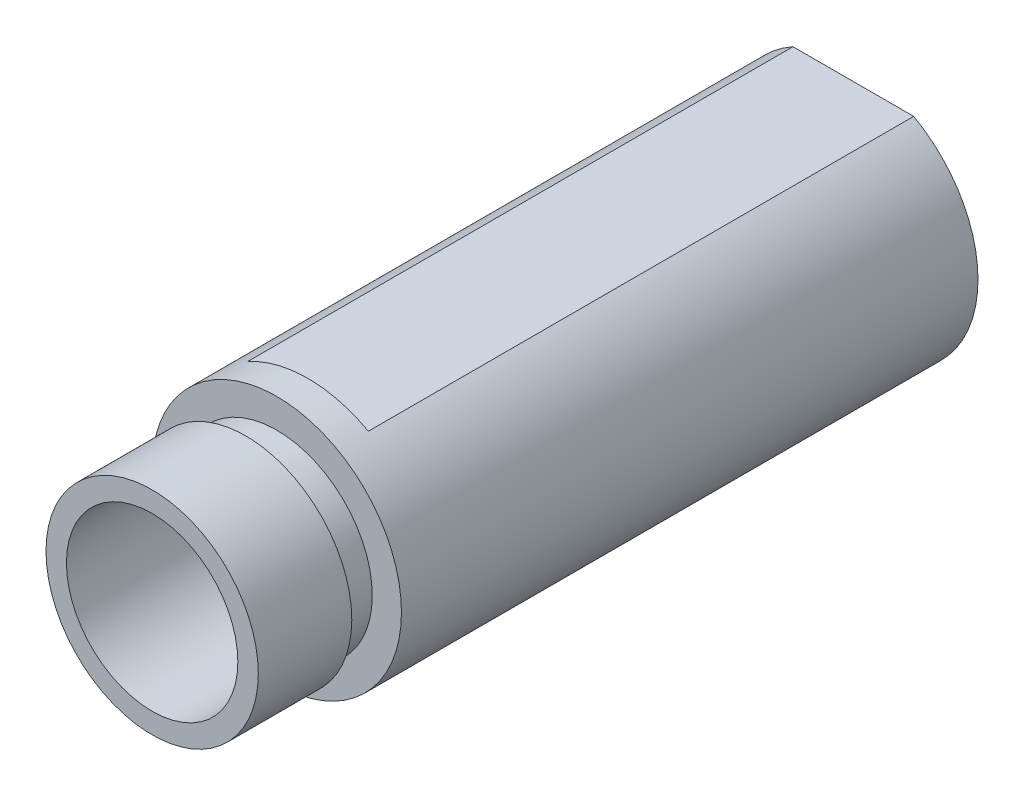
ISO-10303-21;
HEADER;
FILE_DESCRIPTION(('STEP AP214'),'2;1');
FILE_NAME('part.step','',(''),(''),'','','');
FILE_SCHEMA(('AUTOMOTIVE_DESIGN { 1 0 10303 214 1 1 1 1 }'));
ENDSEC;
DATA;
#1=APPLICATION_CONTEXT('core data for automotive mechanical design processes');
#2=APPLICATION_PROTOCOL_DEFINITION('international standard','automotive_design',2000,#1);
#3=PRODUCT_CONTEXT('',#1,'mechanical');
#4=PRODUCT('Part','Part','',(#3));
#5=PRODUCT_RELATED_PRODUCT_CATEGORY('part','',(#4));
#6=PRODUCT_DEFINITION_FORMATION('','',#4);
#7=PRODUCT_DEFINITION_CONTEXT('part definition',#1,'design');
#8=PRODUCT_DEFINITION('design','',#6,#7);
#9=PRODUCT_DEFINITION_SHAPE('','',#8);
#10=(LENGTH_UNIT() NAMED_UNIT(*) SI_UNIT(.MILLI.,.METRE.));
#11=(NAMED_UNIT(*) PLANE_ANGLE_UNIT() SI_UNIT($,.RADIAN.));
#12=(NAMED_UNIT(*) SI_UNIT($,.STERADIAN.) SOLID_ANGLE_UNIT());
#13=UNCERTAINTY_MEASURE_WITH_UNIT(LENGTH_MEASURE(1.E-05),#10,'distance_accuracy_value','');
#14=(GEOMETRIC_REPRESENTATION_CONTEXT(3) GLOBAL_UNCERTAINTY_ASSIGNED_CONTEXT((#13)) GLOBAL_UNIT_ASSIGNED_CONTEXT((#10,
#11,#12)) REPRESENTATION_CONTEXT('',''));
#15=CARTESIAN_POINT('',(0.,0.,0.));
#16=DIRECTION('',(0.,0.,1.));
#17=DIRECTION('',(1.,0.,0.));
#18=AXIS2_PLACEMENT_3D('',#15,#16,#17);
#19=CARTESIAN_POINT('',(0.,0.,0.));
#20=DIRECTION('',(0.,0.,1.));
#21=DIRECTION('',(1.,0.,0.));
#22=AXIS2_PLACEMENT_3D('',#19,#20,#21);
#23=CYLINDRICAL_SURFACE('',#22,8.);
#24=DIRECTION('',(0.,0.,1.));
#25=VECTOR('',#24,1.);
#26=CARTESIAN_POINT('',(3.87298334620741,7.,0.));
#27=LINE('',#26,#25);
#28=CARTESIAN_POINT('',(3.87298334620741,7.,35.));
#29=VERTEX_POINT('',#28);
#30=CARTESIAN_POINT('',(3.87298334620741,7.,0.));
#31=VERTEX_POINT('',#30);
#32=EDGE_CURVE('E63',#29,#31,#27,.F.);
#33=ORIENTED_EDGE('',*,*,#32,.F.);
#34=CARTESIAN_POINT('',(0.,0.,35.));
#35=DIRECTION('',(0.,0.,1.));
#36=DIRECTION('',(1.,0.,0.));
#37=AXIS2_PLACEMENT_3D('',#34,#35,#36);
#38=CIRCLE('',#37,8.);
#39=CARTESIAN_POINT('',(-3.8729833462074,7.00000000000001,35.));
#40=VERTEX_POINT('',#39);
#41=EDGE_CURVE('E14',#40,#29,#38,.F.);
#42=ORIENTED_EDGE('',*,*,#41,.F.);
#43=DIRECTION('',(0.,0.,1.));
#44=VECTOR('',#43,1.);
#45=CARTESIAN_POINT('',(-3.8729833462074,7.00000000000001,0.));
#46=LINE('',#45,#44);
#47=CARTESIAN_POINT('',(-3.8729833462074,7.00000000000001,0.));
#48=VERTEX_POINT('',#47);
#49=EDGE_CURVE('E68',#48,#40,#46,.T.);
#50=ORIENTED_EDGE('',*,*,#49,.F.);
#51=CARTESIAN_POINT('',(0.,0.,0.));
#52=DIRECTION('',(0.,0.,1.));
#53=DIRECTION('',(1.,0.,0.));
#54=AXIS2_PLACEMENT_3D('',#51,#52,#53);
#55=CIRCLE('',#54,8.);
#56=EDGE_CURVE('E81',#48,#31,#55,.T.);
#57=ORIENTED_EDGE('',*,*,#56,.T.);
#58=EDGE_LOOP('',(#33,#42,#50,#57));
#59=FACE_BOUND('',#58,.T.);
#60=CARTESIAN_POINT('',(0.,0.,37.));
#61=DIRECTION('',(0.,0.,1.));
#62=DIRECTION('',(1.,0.,0.));
#63=AXIS2_PLACEMENT_3D('',#60,#61,#62);
#64=CIRCLE('',#63,8.);
#65=CARTESIAN_POINT('',(8.,0.,37.));
#66=VERTEX_POINT('',#65);
#67=EDGE_CURVE('E92',#66,#66,#64,.F.);
#68=ORIENTED_EDGE('',*,*,#67,.T.);
#69=EDGE_LOOP('',(#68));
#70=FACE_BOUND('',#69,.T.);
#71=ADVANCED_FACE('F48',(#59,#70),#23,.T.);
#72=CARTESIAN_POINT('',(0.,0.,45.));
#73=DIRECTION('',(0.,0.,1.));
#74=DIRECTION('',(1.,0.,0.));
#75=AXIS2_PLACEMENT_3D('',#72,#73,#74);
#76=PLANE('',#75);
#77=CARTESIAN_POINT('',(0.,0.,45.));
#78=DIRECTION('',(0.,0.,1.));
#79=DIRECTION('',(1.,0.,0.));
#80=AXIS2_PLACEMENT_3D('',#77,#78,#79);
#81=CIRCLE('',#80,5.5);
#82=CARTESIAN_POINT('',(5.5,0.,45.));
#83=VERTEX_POINT('',#82);
#84=EDGE_CURVE('E98',#83,#83,#81,.T.);
#85=ORIENTED_EDGE('',*,*,#84,.F.);
#86=EDGE_LOOP('',(#85));
#87=FACE_BOUND('',#86,.T.);
#88=CARTESIAN_POINT('',(0.,0.,45.));
#89=DIRECTION('',(0.,0.,1.));
#90=DIRECTION('',(1.,0.,0.));
#91=AXIS2_PLACEMENT_3D('',#88,#89,#90);
#92=CIRCLE('',#91,6.811875);
#93=CARTESIAN_POINT('',(6.811875,0.,45.));
#94=VERTEX_POINT('',#93);
#95=EDGE_CURVE('E86',#94,#94,#92,.T.);
#96=ORIENTED_EDGE('',*,*,#95,.T.);
#97=EDGE_LOOP('',(#96));
#98=FACE_BOUND('',#97,.T.);
#99=ADVANCED_FACE('F50',(#87,#98),#76,.T.);
#100=CARTESIAN_POINT('',(0.,0.,0.));
#101=DIRECTION('',(0.,0.,1.));
#102=DIRECTION('',(1.,0.,0.));
#103=AXIS2_PLACEMENT_3D('',#100,#101,#102);
#104=PLANE('',#103);
#105=CARTESIAN_POINT('',(0.,0.,0.));
#106=DIRECTION('',(0.,0.,1.));
#107=DIRECTION('',(1.,0.,0.));
#108=AXIS2_PLACEMENT_3D('',#105,#106,#107);
#109=CIRCLE('',#108,4.);
#110=CARTESIAN_POINT('',(4.,0.,0.));
#111=VERTEX_POINT('',#110);
#112=EDGE_CURVE('E89',#111,#111,#109,.T.);
#113=ORIENTED_EDGE('',*,*,#112,.T.);
#114=EDGE_LOOP('',(#113));
#115=FACE_BOUND('',#114,.T.);
#116=ORIENTED_EDGE('',*,*,#56,.F.);
#117=DIRECTION('',(1.,0.,0.));
#118=VECTOR('',#117,1.);
#119=CARTESIAN_POINT('',(0.,7.,0.));
#120=LINE('',#119,#118);
#121=EDGE_CURVE('E56',#48,#31,#120,.T.);
#122=ORIENTED_EDGE('',*,*,#121,.T.);
#123=EDGE_LOOP('',(#116,#122));
#124=FACE_BOUND('',#123,.T.);
#125=ADVANCED_FACE('F84',(#115,#124),#104,.F.);
#126=CARTESIAN_POINT('',(0.,0.,3.));
#127=DIRECTION('',(0.,0.,1.));
#128=DIRECTION('',(1.,0.,0.));
#129=AXIS2_PLACEMENT_3D('',#126,#127,#128);
#130=CYLINDRICAL_SURFACE('',#129,5.5);
#131=CARTESIAN_POINT('',(0.,0.,3.));
#132=DIRECTION('',(0.,0.,1.));
#133=DIRECTION('',(1.,0.,0.));
#134=AXIS2_PLACEMENT_3D('',#131,#132,#133);
#135=CIRCLE('',#134,5.5);
#136=CARTESIAN_POINT('',(5.5,0.,3.));
#137=VERTEX_POINT('',#136);
#138=EDGE_CURVE('E77',#137,#137,#135,.T.);
#139=ORIENTED_EDGE('',*,*,#138,.F.);
#140=EDGE_LOOP('',(#139));
#141=FACE_BOUND('',#140,.T.);
#142=ORIENTED_EDGE('',*,*,#84,.T.);
#143=EDGE_LOOP('',(#142));
#144=FACE_BOUND('',#143,.T.);
#145=ADVANCED_FACE('F143',(#141,#144),#130,.F.);
#146=CARTESIAN_POINT('',(0.,0.,3.));
#147=DIRECTION('',(0.,0.,1.));
#148=DIRECTION('',(1.,0.,0.));
#149=AXIS2_PLACEMENT_3D('',#146,#147,#148);
#150=PLANE('',#149);
#151=CARTESIAN_POINT('',(0.,0.,3.));
#152=DIRECTION('',(0.,0.,1.));
#153=DIRECTION('',(1.,0.,0.));
#154=AXIS2_PLACEMENT_3D('',#151,#152,#153);
#155=CIRCLE('',#154,4.);
#156=CARTESIAN_POINT('',(4.,0.,3.));
#157=VERTEX_POINT('',#156);
#158=EDGE_CURVE('E85',#157,#157,#155,.T.);
#159=ORIENTED_EDGE('',*,*,#158,.F.);
#160=EDGE_LOOP('',(#159));
#161=FACE_BOUND('',#160,.T.);
#162=ORIENTED_EDGE('',*,*,#138,.T.);
#163=EDGE_LOOP('',(#162));
#164=FACE_BOUND('',#163,.T.);
#165=ADVANCED_FACE('F139',(#161,#164),#150,.T.);
#166=CARTESIAN_POINT('',(0.,0.,0.));
#167=DIRECTION('',(0.,0.,1.));
#168=DIRECTION('',(1.,0.,0.));
#169=AXIS2_PLACEMENT_3D('',#166,#167,#168);
#170=CYLINDRICAL_SURFACE('',#169,4.);
#171=ORIENTED_EDGE('',*,*,#112,.F.);
#172=EDGE_LOOP('',(#171));
#173=FACE_BOUND('',#172,.T.);
#174=ORIENTED_EDGE('',*,*,#158,.T.);
#175=EDGE_LOOP('',(#174));
#176=FACE_BOUND('',#175,.T.);
#177=ADVANCED_FACE('F136',(#173,#176),#170,.F.);
#178=CARTESIAN_POINT('',(0.,0.,39.));
#179=DIRECTION('',(0.,0.,1.));
#180=DIRECTION('',(1.,0.,0.));
#181=AXIS2_PLACEMENT_3D('',#178,#179,#180);
#182=CYLINDRICAL_SURFACE('',#181,6.811875);
#183=CARTESIAN_POINT('',(0.,0.,39.));
#184=DIRECTION('',(0.,0.,1.));
#185=DIRECTION('',(1.,0.,0.));
#186=AXIS2_PLACEMENT_3D('',#183,#184,#185);
#187=CIRCLE('',#186,6.811875);
#188=CARTESIAN_POINT('',(6.811875,0.,39.));
#189=VERTEX_POINT('',#188);
#190=EDGE_CURVE('E104',#189,#189,#187,.F.);
#191=ORIENTED_EDGE('',*,*,#190,.F.);
#192=EDGE_LOOP('',(#191));
#193=FACE_BOUND('',#192,.T.);
#194=ORIENTED_EDGE('',*,*,#95,.F.);
#195=EDGE_LOOP('',(#194));
#196=FACE_BOUND('',#195,.T.);
#197=ADVANCED_FACE('F134',(#193,#196),#182,.T.);
#198=CARTESIAN_POINT('',(0.,0.,37.));
#199=DIRECTION('',(0.,0.,1.));
#200=DIRECTION('',(1.,0.,0.));
#201=AXIS2_PLACEMENT_3D('',#198,#199,#200);
#202=PLANE('',#201);
#203=ORIENTED_EDGE('',*,*,#67,.F.);
#204=EDGE_LOOP('',(#203));
#205=FACE_BOUND('',#204,.T.);
#206=CARTESIAN_POINT('',(0.,0.,37.));
#207=DIRECTION('',(0.,0.,1.));
#208=DIRECTION('',(1.,0.,0.));
#209=AXIS2_PLACEMENT_3D('',#206,#207,#208);
#210=CIRCLE('',#209,6.125);
#211=CARTESIAN_POINT('',(6.125,0.,37.));
#212=VERTEX_POINT('',#211);
#213=EDGE_CURVE('E107',#212,#212,#210,.T.);
#214=ORIENTED_EDGE('',*,*,#213,.F.);
#215=EDGE_LOOP('',(#214));
#216=FACE_BOUND('',#215,.T.);
#217=ADVANCED_FACE('F162',(#205,#216),#202,.T.);
#218=CARTESIAN_POINT('',(0.,0.,39.));
#219=DIRECTION('',(0.,0.,1.));
#220=DIRECTION('',(1.,0.,0.));
#221=AXIS2_PLACEMENT_3D('',#218,#219,#220);
#222=PLANE('',#221);
#223=ORIENTED_EDGE('',*,*,#190,.T.);
#224=EDGE_LOOP('',(#223));
#225=FACE_BOUND('',#224,.T.);
#226=CARTESIAN_POINT('',(0.,0.,39.));
#227=DIRECTION('',(0.,0.,1.));
#228=DIRECTION('',(1.,0.,0.));
#229=AXIS2_PLACEMENT_3D('',#226,#227,#228);
#230=CIRCLE('',#229,6.125);
#231=CARTESIAN_POINT('',(6.125,0.,39.));
#232=VERTEX_POINT('',#231);
#233=EDGE_CURVE('E111',#232,#232,#230,.T.);
#234=ORIENTED_EDGE('',*,*,#233,.T.);
#235=EDGE_LOOP('',(#234));
#236=FACE_BOUND('',#235,.T.);
#237=ADVANCED_FACE('F167',(#225,#236),#222,.F.);
#238=CARTESIAN_POINT('',(0.,0.,37.));
#239=DIRECTION('',(0.,0.,1.));
#240=DIRECTION('',(1.,0.,0.));
#241=AXIS2_PLACEMENT_3D('',#238,#239,#240);
#242=CYLINDRICAL_SURFACE('',#241,6.125);
#243=ORIENTED_EDGE('',*,*,#213,.T.);
#244=EDGE_LOOP('',(#243));
#245=FACE_BOUND('',#244,.T.);
#246=ORIENTED_EDGE('',*,*,#233,.F.);
#247=EDGE_LOOP('',(#246));
#248=FACE_BOUND('',#247,.T.);
#249=ADVANCED_FACE('F124',(#245,#248),#242,.T.);
#250=CARTESIAN_POINT('',(16.8723538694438,7.00000000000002,35.));
#251=DIRECTION('',(0.,-1.,0.));
#252=DIRECTION('',(0.,0.,-1.));
#253=AXIS2_PLACEMENT_3D('',#250,#251,#252);
#254=PLANE('',#253);
#255=ORIENTED_EDGE('',*,*,#32,.T.);
#256=ORIENTED_EDGE('',*,*,#121,.F.);
#257=ORIENTED_EDGE('',*,*,#49,.T.);
#258=DIRECTION('',(-1.,0.,0.));
#259=VECTOR('',#258,1.);
#260=CARTESIAN_POINT('',(16.8723538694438,7.00000000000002,35.));
#261=LINE('',#260,#259);
#262=EDGE_CURVE('E82',#29,#40,#261,.T.);
#263=ORIENTED_EDGE('',*,*,#262,.F.);
#264=EDGE_LOOP('',(#255,#256,#257,#263));
#265=FACE_BOUND('',#264,.T.);
#266=ADVANCED_FACE('F73',(#265),#254,.F.);
#267=CARTESIAN_POINT('',(16.8723538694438,15.8683036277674,35.));
#268=DIRECTION('',(0.,0.,1.));
#269=DIRECTION('',(1.,0.,0.));
#270=AXIS2_PLACEMENT_3D('',#267,#268,#269);
#271=PLANE('',#270);
#272=ORIENTED_EDGE('',*,*,#41,.T.);
#273=ORIENTED_EDGE('',*,*,#262,.T.);
#274=EDGE_LOOP('',(#272,#273));
#275=FACE_BOUND('',#274,.T.);
#276=ADVANCED_FACE('F118',(#275),#271,.F.);
#277=CLOSED_SHELL('',(#71,#99,#125,#145,#165,#177,#197,#217,#237,#249,#266,#276));
#278=MANIFOLD_SOLID_BREP('B2',#277);
#279=ADVANCED_BREP_SHAPE_REPRESENTATION('',(#18,#278),#14);
#280=SHAPE_DEFINITION_REPRESENTATION(#9,#279);
ENDSEC;
END-ISO-10303-21;
